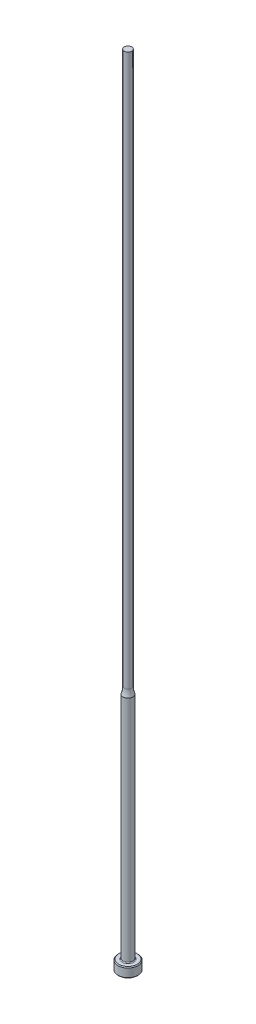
ISO-10303-21;
HEADER;
FILE_DESCRIPTION(('STEP AP214'),'2;1');
FILE_NAME('part.step','',(''),(''),'','','');
FILE_SCHEMA(('AUTOMOTIVE_DESIGN { 1 0 10303 214 1 1 1 1 }'));
ENDSEC;
DATA;
#1=APPLICATION_CONTEXT('core data for automotive mechanical design processes');
#2=APPLICATION_PROTOCOL_DEFINITION('international standard','automotive_design',2000,#1);
#3=PRODUCT_CONTEXT('',#1,'mechanical');
#4=PRODUCT('Part','Part','',(#3));
#5=PRODUCT_RELATED_PRODUCT_CATEGORY('part','',(#4));
#6=PRODUCT_DEFINITION_FORMATION('','',#4);
#7=PRODUCT_DEFINITION_CONTEXT('part definition',#1,'design');
#8=PRODUCT_DEFINITION('design','',#6,#7);
#9=PRODUCT_DEFINITION_SHAPE('','',#8);
#10=(LENGTH_UNIT() NAMED_UNIT(*) SI_UNIT(.MILLI.,.METRE.));
#11=(NAMED_UNIT(*) PLANE_ANGLE_UNIT() SI_UNIT($,.RADIAN.));
#12=(NAMED_UNIT(*) SI_UNIT($,.STERADIAN.) SOLID_ANGLE_UNIT());
#13=UNCERTAINTY_MEASURE_WITH_UNIT(LENGTH_MEASURE(1.E-05),#10,'distance_accuracy_value','');
#14=(GEOMETRIC_REPRESENTATION_CONTEXT(3) GLOBAL_UNCERTAINTY_ASSIGNED_CONTEXT((#13)) GLOBAL_UNIT_ASSIGNED_CONTEXT((#10,
#11,#12)) REPRESENTATION_CONTEXT('',''));
#15=CARTESIAN_POINT('',(0.,0.,0.));
#16=DIRECTION('',(0.,0.,1.));
#17=DIRECTION('',(1.,0.,0.));
#18=AXIS2_PLACEMENT_3D('',#15,#16,#17);
#19=CARTESIAN_POINT('',(-1.18998999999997,254.,0.));
#20=DIRECTION('',(0.,1.,0.));
#21=DIRECTION('',(0.,0.,1.));
#22=AXIS2_PLACEMENT_3D('',#19,#20,#21);
#23=PLANE('',#22);
#24=CARTESIAN_POINT('',(0.,254.,0.));
#25=DIRECTION('',(0.,1.,0.));
#26=DIRECTION('',(0.,0.,1.));
#27=AXIS2_PLACEMENT_3D('',#24,#25,#26);
#28=CIRCLE('',#27,1.18998999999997);
#29=CARTESIAN_POINT('',(0.,254.,1.18998999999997));
#30=VERTEX_POINT('',#29);
#31=EDGE_CURVE('E61',#30,#30,#28,.T.);
#32=ORIENTED_EDGE('',*,*,#31,.T.);
#33=EDGE_LOOP('',(#32));
#34=FACE_BOUND('',#33,.T.);
#35=ADVANCED_FACE('F35',(#34),#23,.T.);
#36=CARTESIAN_POINT('',(0.,259.958771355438,0.));
#37=DIRECTION('',(0.,1.,0.));
#38=DIRECTION('',(0.,0.,1.));
#39=AXIS2_PLACEMENT_3D('',#36,#37,#38);
#40=CYLINDRICAL_SURFACE('',#39,1.18998999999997);
#41=CARTESIAN_POINT('',(0.,78.4114164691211,0.));
#42=DIRECTION('',(0.,1.,0.));
#43=DIRECTION('',(0.,0.,1.));
#44=AXIS2_PLACEMENT_3D('',#41,#42,#43);
#45=CIRCLE('',#44,1.18998999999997);
#46=CARTESIAN_POINT('',(0.,78.4114164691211,1.18998999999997));
#47=VERTEX_POINT('',#46);
#48=EDGE_CURVE('E64',#47,#47,#45,.T.);
#49=ORIENTED_EDGE('',*,*,#48,.T.);
#50=EDGE_LOOP('',(#49));
#51=FACE_BOUND('',#50,.T.);
#52=ORIENTED_EDGE('',*,*,#31,.F.);
#53=EDGE_LOOP('',(#52));
#54=FACE_BOUND('',#53,.T.);
#55=ADVANCED_FACE('F84',(#51,#54),#40,.T.);
#56=CARTESIAN_POINT('',(0.,78.4114164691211,0.));
#57=DIRECTION('',(0.,1.,0.));
#58=DIRECTION('',(0.,0.,1.));
#59=AXIS2_PLACEMENT_3D('',#56,#57,#58);
#60=TOROIDAL_SURFACE('',#59,7.53998999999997,6.35);
#61=CARTESIAN_POINT('',(0.,76.2,0.));
#62=DIRECTION('',(0.,1.,0.));
#63=DIRECTION('',(0.,0.,1.));
#64=AXIS2_PLACEMENT_3D('',#61,#62,#63);
#65=CIRCLE('',#64,1.58749999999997);
#66=CARTESIAN_POINT('',(0.,76.2,1.58749999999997));
#67=VERTEX_POINT('',#66);
#68=EDGE_CURVE('E67',#67,#67,#65,.T.);
#69=ORIENTED_EDGE('',*,*,#68,.T.);
#70=EDGE_LOOP('',(#69));
#71=FACE_BOUND('',#70,.T.);
#72=ORIENTED_EDGE('',*,*,#48,.F.);
#73=EDGE_LOOP('',(#72));
#74=FACE_BOUND('',#73,.T.);
#75=ADVANCED_FACE('F71',(#71,#74),#60,.F.);
#76=CARTESIAN_POINT('',(0.,259.958771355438,0.));
#77=DIRECTION('',(0.,1.,0.));
#78=DIRECTION('',(0.,0.,1.));
#79=AXIS2_PLACEMENT_3D('',#76,#77,#78);
#80=CYLINDRICAL_SURFACE('',#79,1.58749999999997);
#81=CARTESIAN_POINT('',(0.,3.42900000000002,0.));
#82=DIRECTION('',(0.,1.,0.));
#83=DIRECTION('',(0.,0.,1.));
#84=AXIS2_PLACEMENT_3D('',#81,#82,#83);
#85=CIRCLE('',#84,1.58749999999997);
#86=CARTESIAN_POINT('',(0.,3.42900000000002,1.58749999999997));
#87=VERTEX_POINT('',#86);
#88=EDGE_CURVE('E42',#87,#87,#85,.T.);
#89=ORIENTED_EDGE('',*,*,#88,.T.);
#90=EDGE_LOOP('',(#89));
#91=FACE_BOUND('',#90,.T.);
#92=ORIENTED_EDGE('',*,*,#68,.F.);
#93=EDGE_LOOP('',(#92));
#94=FACE_BOUND('',#93,.T.);
#95=ADVANCED_FACE('F74',(#91,#94),#80,.T.);
#96=CARTESIAN_POINT('',(-3.17499999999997,3.175,0.));
#97=DIRECTION('',(0.,1.,0.));
#98=DIRECTION('',(0.,0.,1.));
#99=AXIS2_PLACEMENT_3D('',#96,#97,#98);
#100=PLANE('',#99);
#101=CARTESIAN_POINT('',(0.,3.175,0.));
#102=DIRECTION('',(0.,1.,0.));
#103=DIRECTION('',(0.,0.,1.));
#104=AXIS2_PLACEMENT_3D('',#101,#102,#103);
#105=CIRCLE('',#104,1.84149999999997);
#106=CARTESIAN_POINT('',(0.,3.175,1.84149999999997));
#107=VERTEX_POINT('',#106);
#108=EDGE_CURVE('E10',#107,#107,#105,.F.);
#109=ORIENTED_EDGE('',*,*,#108,.T.);
#110=EDGE_LOOP('',(#109));
#111=FACE_BOUND('',#110,.T.);
#112=CARTESIAN_POINT('',(0.,3.175,0.));
#113=DIRECTION('',(0.,1.,0.));
#114=DIRECTION('',(0.,0.,1.));
#115=AXIS2_PLACEMENT_3D('',#112,#113,#114);
#116=CIRCLE('',#115,2.92099999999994);
#117=CARTESIAN_POINT('',(0.,3.175,2.92099999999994));
#118=VERTEX_POINT('',#117);
#119=EDGE_CURVE('E58',#118,#118,#116,.T.);
#120=ORIENTED_EDGE('',*,*,#119,.T.);
#121=EDGE_LOOP('',(#120));
#122=FACE_BOUND('',#121,.T.);
#123=ADVANCED_FACE('F76',(#111,#122),#100,.T.);
#124=CARTESIAN_POINT('',(0.,259.958771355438,0.));
#125=DIRECTION('',(0.,1.,0.));
#126=DIRECTION('',(0.,0.,1.));
#127=AXIS2_PLACEMENT_3D('',#124,#125,#126);
#128=CYLINDRICAL_SURFACE('',#127,3.17499999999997);
#129=CARTESIAN_POINT('',(0.,2.92100000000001,0.));
#130=DIRECTION('',(0.,1.,0.));
#131=DIRECTION('',(0.,0.,1.));
#132=AXIS2_PLACEMENT_3D('',#129,#130,#131);
#133=CIRCLE('',#132,3.17499999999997);
#134=CARTESIAN_POINT('',(0.,2.92100000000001,3.17499999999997));
#135=VERTEX_POINT('',#134);
#136=EDGE_CURVE('E50',#135,#135,#133,.F.);
#137=ORIENTED_EDGE('',*,*,#136,.T.);
#138=EDGE_LOOP('',(#137));
#139=FACE_BOUND('',#138,.T.);
#140=CARTESIAN_POINT('',(0.,0.253999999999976,0.));
#141=DIRECTION('',(0.,-1.,0.));
#142=DIRECTION('',(0.,0.,-1.));
#143=AXIS2_PLACEMENT_3D('',#140,#141,#142);
#144=CIRCLE('',#143,3.17499999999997);
#145=CARTESIAN_POINT('',(0.,0.253999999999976,-3.17499999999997));
#146=VERTEX_POINT('',#145);
#147=EDGE_CURVE('E55',#146,#146,#144,.F.);
#148=ORIENTED_EDGE('',*,*,#147,.T.);
#149=EDGE_LOOP('',(#148));
#150=FACE_BOUND('',#149,.T.);
#151=ADVANCED_FACE('F82',(#139,#150),#128,.T.);
#152=CARTESIAN_POINT('',(0.,0.,0.));
#153=DIRECTION('',(0.,-1.,0.));
#154=DIRECTION('',(0.,0.,-1.));
#155=AXIS2_PLACEMENT_3D('',#152,#153,#154);
#156=PLANE('',#155);
#157=CARTESIAN_POINT('',(0.,0.,0.));
#158=DIRECTION('',(0.,-1.,0.));
#159=DIRECTION('',(0.,0.,-1.));
#160=AXIS2_PLACEMENT_3D('',#157,#158,#159);
#161=CIRCLE('',#160,2.92100000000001);
#162=CARTESIAN_POINT('',(0.,0.,-2.92100000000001));
#163=VERTEX_POINT('',#162);
#164=EDGE_CURVE('E46',#163,#163,#161,.T.);
#165=ORIENTED_EDGE('',*,*,#164,.T.);
#166=EDGE_LOOP('',(#165));
#167=FACE_BOUND('',#166,.T.);
#168=ADVANCED_FACE('F98',(#167),#156,.T.);
#169=CARTESIAN_POINT('',(0.,3.17499999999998,0.));
#170=DIRECTION('',(0.,-1.,0.));
#171=DIRECTION('',(0.,0.,-1.));
#172=AXIS2_PLACEMENT_3D('',#169,#170,#171);
#173=CONICAL_SURFACE('',#172,2.92099999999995,0.785398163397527);
#174=ORIENTED_EDGE('',*,*,#136,.F.);
#175=EDGE_LOOP('',(#174));
#176=FACE_BOUND('',#175,.T.);
#177=ORIENTED_EDGE('',*,*,#119,.F.);
#178=EDGE_LOOP('',(#177));
#179=FACE_BOUND('',#178,.T.);
#180=ADVANCED_FACE('F95',(#176,#179),#173,.T.);
#181=CARTESIAN_POINT('',(0.,0.253999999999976,0.));
#182=DIRECTION('',(0.,1.,0.));
#183=DIRECTION('',(0.,0.,1.));
#184=AXIS2_PLACEMENT_3D('',#181,#182,#183);
#185=CONICAL_SURFACE('',#184,3.17499999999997,0.785398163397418);
#186=ORIENTED_EDGE('',*,*,#164,.F.);
#187=EDGE_LOOP('',(#186));
#188=FACE_BOUND('',#187,.T.);
#189=ORIENTED_EDGE('',*,*,#147,.F.);
#190=EDGE_LOOP('',(#189));
#191=FACE_BOUND('',#190,.T.);
#192=ADVANCED_FACE('F97',(#188,#191),#185,.T.);
#193=CARTESIAN_POINT('',(0.,3.42900000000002,0.));
#194=DIRECTION('',(0.,1.,0.));
#195=DIRECTION('',(0.,0.,1.));
#196=AXIS2_PLACEMENT_3D('',#193,#194,#195);
#197=TOROIDAL_SURFACE('',#196,1.84149999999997,0.254);
#198=ORIENTED_EDGE('',*,*,#108,.F.);
#199=EDGE_LOOP('',(#198));
#200=FACE_BOUND('',#199,.T.);
#201=ORIENTED_EDGE('',*,*,#88,.F.);
#202=EDGE_LOOP('',(#201));
#203=FACE_BOUND('',#202,.T.);
#204=ADVANCED_FACE('F37',(#200,#203),#197,.F.);
#205=CLOSED_SHELL('',(#35,#55,#75,#95,#123,#151,#168,#180,#192,#204));
#206=MANIFOLD_SOLID_BREP('B2',#205);
#207=ADVANCED_BREP_SHAPE_REPRESENTATION('',(#18,#206),#14);
#208=SHAPE_DEFINITION_REPRESENTATION(#9,#207);
ENDSEC;
END-ISO-10303-21;
